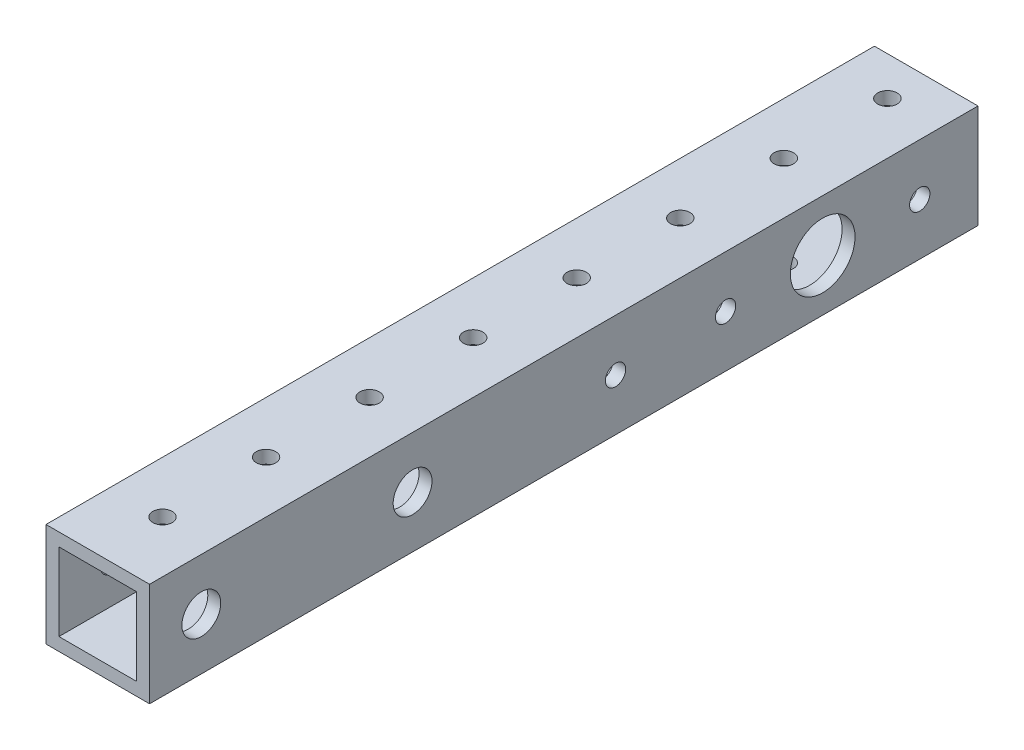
from build123d import *

# Parameters (mm, degrees)
SKETCH1_W           = 25.4
SKETCH1_H           = 25.4
SKETCH1_W_2         = 19.05
SKETCH1_H_2         = 19.05
BOSS_EXTRUDE1_DEPTH = 101.6
SKETCH2_R           = 2.4892
SKETCH2_R_2         = 2.4384
CUT_EXTRUDE1_DEPTH  = 106.494123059
SKETCH3_R           = 2.38125
CUT_EXTRUDE2_DEPTH  = 106.494123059
LPATTERN1_COUNT     = 8
LPATTERN1_PITCH     = 25.4
CUT_EXTRUDE3_REACH  = 107.494
SKETCH4_R           = 4.7625
CUT_EXTRUDE4_REACH  = 107.494
SKETCH5_R           = 2.4892
CUT_EXTRUDE5_REACH  = 107.494
SKETCH6_R           = 4.7625
CUT_EXTRUDE6_REACH  = 106.775
SKETCH7_R           = 4.7625
CUT_EXTRUDE7_REACH  = 107.494
SKETCH8_R           = 7.9375


with BuildPart() as part:
    # Sketch1 → Boss-Extrude1 (new, symmetric)
    with BuildSketch(Plane.XY):
        Rectangle(SKETCH1_W, SKETCH1_H)
        Rectangle(SKETCH1_W_2, SKETCH1_H_2, mode=Mode.SUBTRACT)
    extrude(amount=BOSS_EXTRUDE1_DEPTH, both=True)

    # Sketch2 → Cut-Extrude1 (cut, through all)
    with BuildSketch(Plane(origin=(12.7, 0, 0), x_dir=(0, 0, -1), z_dir=(1, 0, 0))):
        with Locations((12.7, 0)):
            Circle(SKETCH2_R)
        with Locations((39.6875, 0)):
            Circle(SKETCH2_R)
        with Locations((63.5, 0)):
            Circle(SKETCH2_R_2)
        with Locations((87.3125, 0)):
            Circle(SKETCH2_R)
    extrude(amount=-CUT_EXTRUDE1_DEPTH, mode=Mode.SUBTRACT)

    # Sketch3 → Cut-Extrude2 (cut, through all)
    with BuildSketch(Plane(origin=(0, 12.7, 0), x_dir=(1, 0, 0), z_dir=(0, 1, 0))):
        with Locations(Location((0, 92.075, 0), (0, 0, 270))):
            Circle(SKETCH3_R)
    cut_extrude2 = extrude(amount=-CUT_EXTRUDE2_DEPTH, mode=Mode.SUBTRACT)

    # LPattern1: Cut-Extrude2 ×8
    with Locations(*[(0, 0, i * LPATTERN1_PITCH) for i in range(1, LPATTERN1_COUNT)]):
        add(cut_extrude2, mode=Mode.SUBTRACT)

    # Sketch4 → Cut-Extrude3 (cut, up to next)
    with BuildSketch(Plane.ZY.offset(12.7), mode=Mode.PRIVATE) as cut_extrude3_sk1:
        with Locations((-87.3125, 0)):
            Circle(SKETCH4_R)
    cut_extrude3_tool1 = extrude(cut_extrude3_sk1.sketch, amount=-CUT_EXTRUDE3_REACH, mode=Mode.PRIVATE) & part.part
    # Sketch4 → Cut-Extrude3 (cut, up to next)
    with BuildSketch(Plane.ZY.offset(12.7), mode=Mode.PRIVATE) as cut_extrude3_sk2:
        with Locations((-39.6875, 0)):
            Circle(SKETCH4_R)
    cut_extrude3_tool2 = extrude(cut_extrude3_sk2.sketch, amount=-CUT_EXTRUDE3_REACH, mode=Mode.PRIVATE) & part.part
    add(cut_extrude3_tool1.solids().sort_by_distance((-12.7, 0, -87.3125))[0], mode=Mode.SUBTRACT)
    add(cut_extrude3_tool2.solids().sort_by_distance((-12.7, 0, -39.6875))[0], mode=Mode.SUBTRACT)

    # Sketch5 → Cut-Extrude4 (cut, up to next)
    with BuildSketch(Plane.ZY.offset(12.7), mode=Mode.PRIVATE) as cut_extrude4_sk1:
        with Locations((88.9, 0)):
            Circle(SKETCH5_R)
    cut_extrude4_tool1 = extrude(cut_extrude4_sk1.sketch, amount=-CUT_EXTRUDE4_REACH, mode=Mode.PRIVATE) & part.part
    # Sketch5 → Cut-Extrude4 (cut, up to next)
    with BuildSketch(Plane.ZY.offset(12.7), mode=Mode.PRIVATE) as cut_extrude4_sk2:
        with Locations((37.084, 0)):
            Circle(SKETCH5_R)
    cut_extrude4_tool2 = extrude(cut_extrude4_sk2.sketch, amount=-CUT_EXTRUDE4_REACH, mode=Mode.PRIVATE) & part.part
    add(cut_extrude4_tool1.solids().sort_by_distance((-12.7, 0, 88.9))[0], mode=Mode.SUBTRACT)
    add(cut_extrude4_tool2.solids().sort_by_distance((-12.7, 0, 37.084))[0], mode=Mode.SUBTRACT)

    # Sketch6 → Cut-Extrude5 (cut, up to next)
    with BuildSketch(Plane(origin=(12.7, 0, 0), x_dir=(0, 0, -1), z_dir=(1, 0, 0)), mode=Mode.PRIVATE) as cut_extrude5_sk1:
        with Locations((-88.9, 0)):
            Circle(SKETCH6_R)
    cut_extrude5_tool1 = extrude(cut_extrude5_sk1.sketch, amount=-CUT_EXTRUDE5_REACH, mode=Mode.PRIVATE) & part.part
    # Sketch6 → Cut-Extrude5 (cut, up to next)
    with BuildSketch(Plane(origin=(12.7, 0, 0), x_dir=(0, 0, -1), z_dir=(1, 0, 0)), mode=Mode.PRIVATE) as cut_extrude5_sk2:
        with Locations((-37.084, 0)):
            Circle(SKETCH6_R)
    cut_extrude5_tool2 = extrude(cut_extrude5_sk2.sketch, amount=-CUT_EXTRUDE5_REACH, mode=Mode.PRIVATE) & part.part
    add(cut_extrude5_tool1.solids().sort_by_distance((12.7, 0, 88.9))[0], mode=Mode.SUBTRACT)
    add(cut_extrude5_tool2.solids().sort_by_distance((12.7, 0, 37.084))[0], mode=Mode.SUBTRACT)

    # Sketch7 → Cut-Extrude6 (cut, up to next)
    with BuildSketch(Plane(origin=(-9.525, 0, 0), x_dir=(0, 0, -1), z_dir=(1, 0, 0)), mode=Mode.PRIVATE) as cut_extrude6_sk1:
        with Locations((12.7, 0)):
            Circle(SKETCH7_R)
    cut_extrude6_tool1 = extrude(cut_extrude6_sk1.sketch, amount=-CUT_EXTRUDE6_REACH, mode=Mode.PRIVATE) & part.part
    add(cut_extrude6_tool1.solids().sort_by_distance((-9.525, 0, -12.7))[0], mode=Mode.SUBTRACT)

    # Sketch8 → Cut-Extrude7 (cut, up to next)
    with BuildSketch(Plane.ZY.offset(-12.7), mode=Mode.PRIVATE) as cut_extrude7_sk1:
        with Locations(Location((-63.5, 0, 0), (0, 0, 180))):
            Circle(SKETCH8_R)
    cut_extrude7_tool1 = extrude(cut_extrude7_sk1.sketch, amount=CUT_EXTRUDE7_REACH, mode=Mode.PRIVATE) & part.part
    add(cut_extrude7_tool1.solids().sort_by_distance((12.7, 0, -63.5))[0], mode=Mode.SUBTRACT)


solid = part.part
